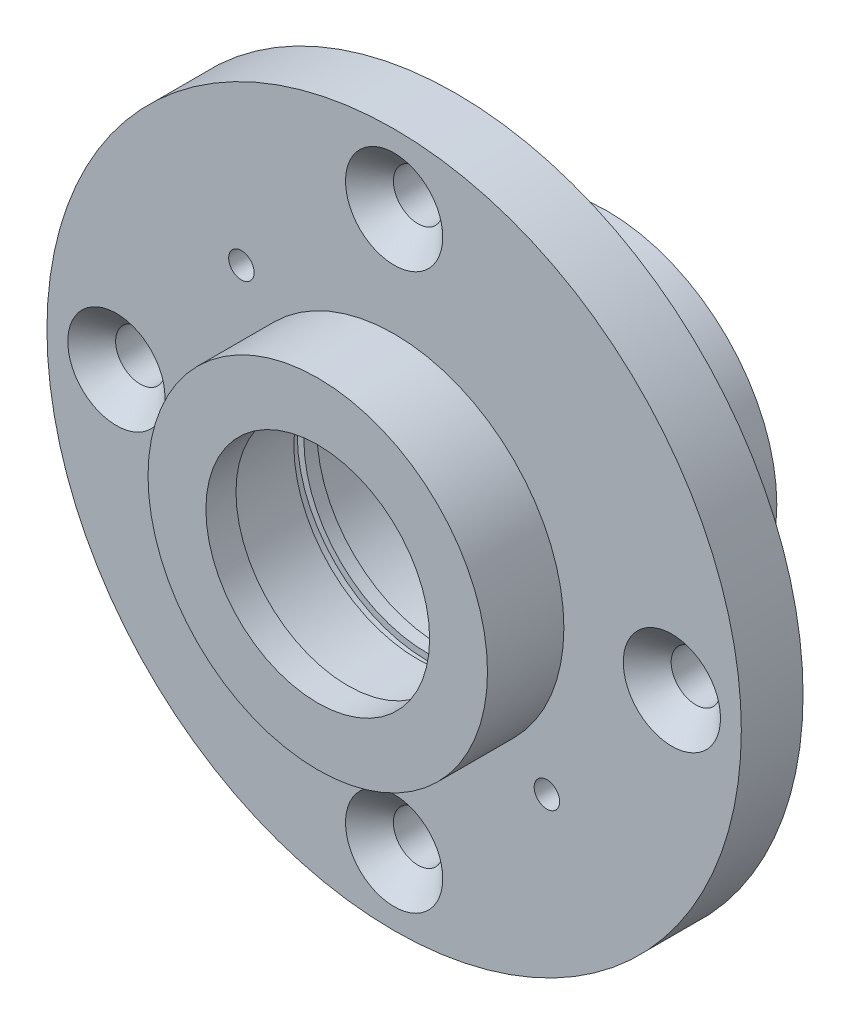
ISO-10303-21;
HEADER;
FILE_DESCRIPTION(('STEP AP214'),'2;1');
FILE_NAME('part.step','',(''),(''),'','','');
FILE_SCHEMA(('AUTOMOTIVE_DESIGN { 1 0 10303 214 1 1 1 1 }'));
ENDSEC;
DATA;
#1=APPLICATION_CONTEXT('core data for automotive mechanical design processes');
#2=APPLICATION_PROTOCOL_DEFINITION('international standard','automotive_design',2000,#1);
#3=PRODUCT_CONTEXT('',#1,'mechanical');
#4=PRODUCT('Part','Part','',(#3));
#5=PRODUCT_RELATED_PRODUCT_CATEGORY('part','',(#4));
#6=PRODUCT_DEFINITION_FORMATION('','',#4);
#7=PRODUCT_DEFINITION_CONTEXT('part definition',#1,'design');
#8=PRODUCT_DEFINITION('design','',#6,#7);
#9=PRODUCT_DEFINITION_SHAPE('','',#8);
#10=(LENGTH_UNIT() NAMED_UNIT(*) SI_UNIT(.MILLI.,.METRE.));
#11=(NAMED_UNIT(*) PLANE_ANGLE_UNIT() SI_UNIT($,.RADIAN.));
#12=(NAMED_UNIT(*) SI_UNIT($,.STERADIAN.) SOLID_ANGLE_UNIT());
#13=UNCERTAINTY_MEASURE_WITH_UNIT(LENGTH_MEASURE(1.E-05),#10,'distance_accuracy_value','');
#14=(GEOMETRIC_REPRESENTATION_CONTEXT(3) GLOBAL_UNCERTAINTY_ASSIGNED_CONTEXT((#13)) GLOBAL_UNIT_ASSIGNED_CONTEXT((#10,
#11,#12)) REPRESENTATION_CONTEXT('',''));
#15=CARTESIAN_POINT('',(0.,0.,0.));
#16=DIRECTION('',(0.,0.,1.));
#17=DIRECTION('',(1.,0.,0.));
#18=AXIS2_PLACEMENT_3D('',#15,#16,#17);
#19=CARTESIAN_POINT('',(0.,0.,33.6));
#20=DIRECTION('',(0.,0.,-1.));
#21=DIRECTION('',(-1.,0.,0.));
#22=AXIS2_PLACEMENT_3D('',#19,#20,#21);
#23=CYLINDRICAL_SURFACE('',#22,16.);
#24=CARTESIAN_POINT('',(0.,0.,23.3));
#25=DIRECTION('',(0.,0.,-1.));
#26=DIRECTION('',(-1.,0.,0.));
#27=AXIS2_PLACEMENT_3D('',#24,#25,#26);
#28=CIRCLE('',#27,16.);
#29=CARTESIAN_POINT('',(-16.,0.,23.3));
#30=VERTEX_POINT('',#29);
#31=EDGE_CURVE('E268',#30,#30,#28,.T.);
#32=ORIENTED_EDGE('',*,*,#31,.F.);
#33=EDGE_LOOP('',(#32));
#34=FACE_BOUND('',#33,.T.);
#35=CARTESIAN_POINT('',(0.,0.,21.6));
#36=DIRECTION('',(0.,0.,-1.));
#37=DIRECTION('',(-1.,0.,0.));
#38=AXIS2_PLACEMENT_3D('',#35,#36,#37);
#39=CIRCLE('',#38,16.);
#40=CARTESIAN_POINT('',(-16.,0.,21.6));
#41=VERTEX_POINT('',#40);
#42=EDGE_CURVE('E43',#41,#41,#39,.F.);
#43=ORIENTED_EDGE('',*,*,#42,.F.);
#44=EDGE_LOOP('',(#43));
#45=FACE_BOUND('',#44,.T.);
#46=ADVANCED_FACE('F39',(#34,#45),#23,.F.);
#47=CARTESIAN_POINT('',(0.,0.,24.6));
#48=DIRECTION('',(0.,0.,-1.));
#49=DIRECTION('',(-1.,0.,0.));
#50=AXIS2_PLACEMENT_3D('',#47,#48,#49);
#51=CIRCLE('',#50,16.);
#52=CARTESIAN_POINT('',(-16.,0.,24.6));
#53=VERTEX_POINT('',#52);
#54=EDGE_CURVE('E259',#53,#53,#51,.T.);
#55=ORIENTED_EDGE('',*,*,#54,.T.);
#56=EDGE_LOOP('',(#55));
#57=FACE_BOUND('',#56,.T.);
#58=CARTESIAN_POINT('',(0.,0.,33.6));
#59=DIRECTION('',(0.,0.,-1.));
#60=DIRECTION('',(-1.,0.,0.));
#61=AXIS2_PLACEMENT_3D('',#58,#59,#60);
#62=CIRCLE('',#61,16.);
#63=CARTESIAN_POINT('',(-16.,0.,33.6));
#64=VERTEX_POINT('',#63);
#65=EDGE_CURVE('E58',#64,#64,#62,.T.);
#66=ORIENTED_EDGE('',*,*,#65,.F.);
#67=EDGE_LOOP('',(#66));
#68=FACE_BOUND('',#67,.T.);
#69=ADVANCED_FACE('F158',(#57,#68),#23,.F.);
#70=CARTESIAN_POINT('',(0.,0.,69.0974746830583));
#71=DIRECTION('',(0.,0.,-1.));
#72=DIRECTION('',(-1.,0.,0.));
#73=AXIS2_PLACEMENT_3D('',#70,#71,#72);
#74=CYLINDRICAL_SURFACE('',#73,17.5);
#75=CARTESIAN_POINT('',(0.,0.,4.6));
#76=DIRECTION('',(0.,0.,-1.));
#77=DIRECTION('',(-1.,0.,0.));
#78=AXIS2_PLACEMENT_3D('',#75,#76,#77);
#79=CIRCLE('',#78,17.5);
#80=CARTESIAN_POINT('',(-17.5,0.,4.6));
#81=VERTEX_POINT('',#80);
#82=EDGE_CURVE('E65',#81,#81,#79,.T.);
#83=ORIENTED_EDGE('',*,*,#82,.T.);
#84=EDGE_LOOP('',(#83));
#85=FACE_BOUND('',#84,.T.);
#86=CARTESIAN_POINT('',(0.,0.,14.6));
#87=DIRECTION('',(0.,0.,1.));
#88=DIRECTION('',(1.,0.,0.));
#89=AXIS2_PLACEMENT_3D('',#86,#87,#88);
#90=CIRCLE('',#89,17.5);
#91=CARTESIAN_POINT('',(17.5,0.,14.6));
#92=VERTEX_POINT('',#91);
#93=EDGE_CURVE('E62',#92,#92,#90,.F.);
#94=ORIENTED_EDGE('',*,*,#93,.F.);
#95=EDGE_LOOP('',(#94));
#96=FACE_BOUND('',#95,.T.);
#97=ADVANCED_FACE('F164',(#85,#96),#74,.F.);
#98=CARTESIAN_POINT('',(0.,0.,37.5));
#99=DIRECTION('',(0.,0.,-1.));
#100=DIRECTION('',(-1.,0.,0.));
#101=AXIS2_PLACEMENT_3D('',#98,#99,#100);
#102=CYLINDRICAL_SURFACE('',#101,14.5);
#103=CARTESIAN_POINT('',(0.,0.,37.5));
#104=DIRECTION('',(0.,0.,1.));
#105=DIRECTION('',(1.,0.,0.));
#106=AXIS2_PLACEMENT_3D('',#103,#104,#105);
#107=CIRCLE('',#106,14.5);
#108=CARTESIAN_POINT('',(14.5,0.,37.5));
#109=VERTEX_POINT('',#108);
#110=EDGE_CURVE('E131',#109,#109,#107,.T.);
#111=ORIENTED_EDGE('',*,*,#110,.T.);
#112=EDGE_LOOP('',(#111));
#113=FACE_BOUND('',#112,.T.);
#114=CARTESIAN_POINT('',(0.,0.,33.6));
#115=DIRECTION('',(0.,0.,-1.));
#116=DIRECTION('',(-1.,0.,0.));
#117=AXIS2_PLACEMENT_3D('',#114,#115,#116);
#118=CIRCLE('',#117,14.5);
#119=CARTESIAN_POINT('',(-14.5,0.,33.6));
#120=VERTEX_POINT('',#119);
#121=EDGE_CURVE('E55',#120,#120,#118,.T.);
#122=ORIENTED_EDGE('',*,*,#121,.T.);
#123=EDGE_LOOP('',(#122));
#124=FACE_BOUND('',#123,.T.);
#125=ADVANCED_FACE('F231',(#113,#124),#102,.F.);
#126=CARTESIAN_POINT('',(0.,0.,37.5));
#127=DIRECTION('',(0.,0.,-1.));
#128=DIRECTION('',(-1.,0.,0.));
#129=AXIS2_PLACEMENT_3D('',#126,#127,#128);
#130=CYLINDRICAL_SURFACE('',#129,22.);
#131=CARTESIAN_POINT('',(0.,0.,0.));
#132=DIRECTION('',(0.,0.,1.));
#133=DIRECTION('',(1.,0.,0.));
#134=AXIS2_PLACEMENT_3D('',#131,#132,#133);
#135=CIRCLE('',#134,22.);
#136=CARTESIAN_POINT('',(22.,0.,0.));
#137=VERTEX_POINT('',#136);
#138=EDGE_CURVE('E52',#137,#137,#135,.T.);
#139=ORIENTED_EDGE('',*,*,#138,.T.);
#140=EDGE_LOOP('',(#139));
#141=FACE_BOUND('',#140,.T.);
#142=CARTESIAN_POINT('',(0.,0.,19.6));
#143=DIRECTION('',(0.,0.,1.));
#144=DIRECTION('',(1.,0.,0.));
#145=AXIS2_PLACEMENT_3D('',#142,#143,#144);
#146=CIRCLE('',#145,22.);
#147=CARTESIAN_POINT('',(22.,0.,19.6));
#148=VERTEX_POINT('',#147);
#149=EDGE_CURVE('E12',#148,#148,#146,.T.);
#150=ORIENTED_EDGE('',*,*,#149,.F.);
#151=EDGE_LOOP('',(#150));
#152=FACE_BOUND('',#151,.T.);
#153=ADVANCED_FACE('F141',(#141,#152),#130,.T.);
#154=CARTESIAN_POINT('',(0.,0.,37.5));
#155=DIRECTION('',(0.,0.,1.));
#156=DIRECTION('',(1.,0.,0.));
#157=AXIS2_PLACEMENT_3D('',#154,#155,#156);
#158=PLANE('',#157);
#159=CARTESIAN_POINT('',(0.,0.,37.5));
#160=DIRECTION('',(0.,0.,1.));
#161=DIRECTION('',(1.,0.,0.));
#162=AXIS2_PLACEMENT_3D('',#159,#160,#161);
#163=CIRCLE('',#162,22.);
#164=CARTESIAN_POINT('',(22.,0.,37.5));
#165=VERTEX_POINT('',#164);
#166=EDGE_CURVE('E47',#165,#165,#163,.T.);
#167=ORIENTED_EDGE('',*,*,#166,.T.);
#168=EDGE_LOOP('',(#167));
#169=FACE_BOUND('',#168,.T.);
#170=ORIENTED_EDGE('',*,*,#110,.F.);
#171=EDGE_LOOP('',(#170));
#172=FACE_BOUND('',#171,.T.);
#173=ADVANCED_FACE('F146',(#169,#172),#158,.T.);
#174=CARTESIAN_POINT('',(0.,0.,0.));
#175=DIRECTION('',(0.,0.,1.));
#176=DIRECTION('',(1.,0.,0.));
#177=AXIS2_PLACEMENT_3D('',#174,#175,#176);
#178=PLANE('',#177);
#179=CARTESIAN_POINT('',(0.,0.,0.));
#180=DIRECTION('',(0.,0.,-1.));
#181=DIRECTION('',(-1.,0.,0.));
#182=AXIS2_PLACEMENT_3D('',#179,#180,#181);
#183=CIRCLE('',#182,17.5);
#184=CARTESIAN_POINT('',(-17.5,0.,0.));
#185=VERTEX_POINT('',#184);
#186=EDGE_CURVE('E57',#185,#185,#183,.T.);
#187=ORIENTED_EDGE('',*,*,#186,.F.);
#188=EDGE_LOOP('',(#187));
#189=FACE_BOUND('',#188,.T.);
#190=ORIENTED_EDGE('',*,*,#138,.F.);
#191=EDGE_LOOP('',(#190));
#192=FACE_BOUND('',#191,.T.);
#193=ADVANCED_FACE('F144',(#189,#192),#178,.F.);
#194=CARTESIAN_POINT('',(0.,0.,27.6));
#195=DIRECTION('',(0.,0.,1.));
#196=DIRECTION('',(1.,0.,0.));
#197=AXIS2_PLACEMENT_3D('',#194,#195,#196);
#198=CIRCLE('',#197,22.);
#199=CARTESIAN_POINT('',(22.,0.,27.6));
#200=VERTEX_POINT('',#199);
#201=EDGE_CURVE('E124',#200,#200,#198,.T.);
#202=ORIENTED_EDGE('',*,*,#201,.T.);
#203=EDGE_LOOP('',(#202));
#204=FACE_BOUND('',#203,.T.);
#205=ORIENTED_EDGE('',*,*,#166,.F.);
#206=EDGE_LOOP('',(#205));
#207=FACE_BOUND('',#206,.T.);
#208=ADVANCED_FACE('F41',(#204,#207),#130,.T.);
#209=CARTESIAN_POINT('',(0.,0.,27.6));
#210=DIRECTION('',(0.,0.,1.));
#211=DIRECTION('',(1.,0.,0.));
#212=AXIS2_PLACEMENT_3D('',#209,#210,#211);
#213=PLANE('',#212);
#214=CARTESIAN_POINT('',(-19.7989898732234,19.7989898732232,27.6));
#215=DIRECTION('',(0.,0.,1.));
#216=DIRECTION('',(1.,0.,0.));
#217=AXIS2_PLACEMENT_3D('',#214,#215,#216);
#218=CIRCLE('',#217,1.65);
#219=CARTESIAN_POINT('',(-18.1489898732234,19.7989898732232,27.6));
#220=VERTEX_POINT('',#219);
#221=EDGE_CURVE('E79',#220,#220,#218,.T.);
#222=ORIENTED_EDGE('',*,*,#221,.F.);
#223=EDGE_LOOP('',(#222));
#224=FACE_BOUND('',#223,.T.);
#225=CARTESIAN_POINT('',(19.7989898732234,-19.7989898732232,27.6));
#226=DIRECTION('',(0.,0.,1.));
#227=DIRECTION('',(1.,0.,0.));
#228=AXIS2_PLACEMENT_3D('',#225,#226,#227);
#229=CIRCLE('',#228,1.65);
#230=CARTESIAN_POINT('',(21.4489898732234,-19.7989898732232,27.6));
#231=VERTEX_POINT('',#230);
#232=EDGE_CURVE('E85',#231,#231,#229,.T.);
#233=ORIENTED_EDGE('',*,*,#232,.F.);
#234=EDGE_LOOP('',(#233));
#235=FACE_BOUND('',#234,.T.);
#236=CARTESIAN_POINT('',(-36.,0.,27.6));
#237=DIRECTION('',(0.,0.,1.));
#238=DIRECTION('',(1.,0.,0.));
#239=AXIS2_PLACEMENT_3D('',#236,#237,#238);
#240=CIRCLE('',#239,6.3);
#241=CARTESIAN_POINT('',(-29.7,0.,27.6));
#242=VERTEX_POINT('',#241);
#243=EDGE_CURVE('E88',#242,#242,#240,.T.);
#244=ORIENTED_EDGE('',*,*,#243,.F.);
#245=EDGE_LOOP('',(#244));
#246=FACE_BOUND('',#245,.T.);
#247=CARTESIAN_POINT('',(0.,36.,27.6));
#248=DIRECTION('',(0.,0.,1.));
#249=DIRECTION('',(1.,0.,0.));
#250=AXIS2_PLACEMENT_3D('',#247,#248,#249);
#251=CIRCLE('',#250,6.3);
#252=CARTESIAN_POINT('',(6.3,36.,27.6));
#253=VERTEX_POINT('',#252);
#254=EDGE_CURVE('E97',#253,#253,#251,.T.);
#255=ORIENTED_EDGE('',*,*,#254,.F.);
#256=EDGE_LOOP('',(#255));
#257=FACE_BOUND('',#256,.T.);
#258=CARTESIAN_POINT('',(36.,0.,27.6));
#259=DIRECTION('',(0.,0.,1.));
#260=DIRECTION('',(1.,0.,0.));
#261=AXIS2_PLACEMENT_3D('',#258,#259,#260);
#262=CIRCLE('',#261,6.3);
#263=CARTESIAN_POINT('',(42.3,0.,27.6));
#264=VERTEX_POINT('',#263);
#265=EDGE_CURVE('E106',#264,#264,#262,.T.);
#266=ORIENTED_EDGE('',*,*,#265,.F.);
#267=EDGE_LOOP('',(#266));
#268=FACE_BOUND('',#267,.T.);
#269=CARTESIAN_POINT('',(0.,-36.,27.6));
#270=DIRECTION('',(0.,0.,1.));
#271=DIRECTION('',(1.,0.,0.));
#272=AXIS2_PLACEMENT_3D('',#269,#270,#271);
#273=CIRCLE('',#272,6.3);
#274=CARTESIAN_POINT('',(6.3,-36.,27.6));
#275=VERTEX_POINT('',#274);
#276=EDGE_CURVE('E115',#275,#275,#273,.T.);
#277=ORIENTED_EDGE('',*,*,#276,.F.);
#278=EDGE_LOOP('',(#277));
#279=FACE_BOUND('',#278,.T.);
#280=CARTESIAN_POINT('',(0.,0.,27.6));
#281=DIRECTION('',(0.,0.,1.));
#282=DIRECTION('',(1.,0.,0.));
#283=AXIS2_PLACEMENT_3D('',#280,#281,#282);
#284=CIRCLE('',#283,45.);
#285=CARTESIAN_POINT('',(45.,0.,27.6));
#286=VERTEX_POINT('',#285);
#287=EDGE_CURVE('E128',#286,#286,#284,.T.);
#288=ORIENTED_EDGE('',*,*,#287,.T.);
#289=EDGE_LOOP('',(#288));
#290=FACE_BOUND('',#289,.T.);
#291=ORIENTED_EDGE('',*,*,#201,.F.);
#292=EDGE_LOOP('',(#291));
#293=FACE_BOUND('',#292,.T.);
#294=ADVANCED_FACE('F152',(#224,#235,#246,#257,#268,#279,#290,#293),#213,.T.);
#295=CARTESIAN_POINT('',(0.,0.,19.6));
#296=DIRECTION('',(0.,0.,1.));
#297=DIRECTION('',(1.,0.,0.));
#298=AXIS2_PLACEMENT_3D('',#295,#296,#297);
#299=PLANE('',#298);
#300=CARTESIAN_POINT('',(-19.7989898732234,19.7989898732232,19.6));
#301=DIRECTION('',(0.,0.,1.));
#302=DIRECTION('',(1.,0.,0.));
#303=AXIS2_PLACEMENT_3D('',#300,#301,#302);
#304=CIRCLE('',#303,1.65);
#305=CARTESIAN_POINT('',(-18.1489898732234,19.7989898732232,19.6));
#306=VERTEX_POINT('',#305);
#307=EDGE_CURVE('E76',#306,#306,#304,.T.);
#308=ORIENTED_EDGE('',*,*,#307,.T.);
#309=EDGE_LOOP('',(#308));
#310=FACE_BOUND('',#309,.T.);
#311=CARTESIAN_POINT('',(19.7989898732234,-19.7989898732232,19.6));
#312=DIRECTION('',(0.,0.,1.));
#313=DIRECTION('',(1.,0.,0.));
#314=AXIS2_PLACEMENT_3D('',#311,#312,#313);
#315=CIRCLE('',#314,1.65);
#316=CARTESIAN_POINT('',(21.4489898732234,-19.7989898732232,19.6));
#317=VERTEX_POINT('',#316);
#318=EDGE_CURVE('E82',#317,#317,#315,.T.);
#319=ORIENTED_EDGE('',*,*,#318,.T.);
#320=EDGE_LOOP('',(#319));
#321=FACE_BOUND('',#320,.T.);
#322=CARTESIAN_POINT('',(-36.,0.,19.6));
#323=DIRECTION('',(0.,0.,1.));
#324=DIRECTION('',(1.,0.,0.));
#325=AXIS2_PLACEMENT_3D('',#322,#323,#324);
#326=CIRCLE('',#325,3.2);
#327=CARTESIAN_POINT('',(-32.8,0.,19.6));
#328=VERTEX_POINT('',#327);
#329=EDGE_CURVE('E94',#328,#328,#326,.T.);
#330=ORIENTED_EDGE('',*,*,#329,.T.);
#331=EDGE_LOOP('',(#330));
#332=FACE_BOUND('',#331,.T.);
#333=CARTESIAN_POINT('',(0.,36.,19.6));
#334=DIRECTION('',(0.,0.,1.));
#335=DIRECTION('',(1.,0.,0.));
#336=AXIS2_PLACEMENT_3D('',#333,#334,#335);
#337=CIRCLE('',#336,3.2);
#338=CARTESIAN_POINT('',(3.2,36.,19.6));
#339=VERTEX_POINT('',#338);
#340=EDGE_CURVE('E103',#339,#339,#337,.T.);
#341=ORIENTED_EDGE('',*,*,#340,.T.);
#342=EDGE_LOOP('',(#341));
#343=FACE_BOUND('',#342,.T.);
#344=CARTESIAN_POINT('',(36.,0.,19.6));
#345=DIRECTION('',(0.,0.,1.));
#346=DIRECTION('',(1.,0.,0.));
#347=AXIS2_PLACEMENT_3D('',#344,#345,#346);
#348=CIRCLE('',#347,3.2);
#349=CARTESIAN_POINT('',(39.2,0.,19.6));
#350=VERTEX_POINT('',#349);
#351=EDGE_CURVE('E112',#350,#350,#348,.T.);
#352=ORIENTED_EDGE('',*,*,#351,.T.);
#353=EDGE_LOOP('',(#352));
#354=FACE_BOUND('',#353,.T.);
#355=CARTESIAN_POINT('',(0.,-36.,19.6));
#356=DIRECTION('',(0.,0.,1.));
#357=DIRECTION('',(1.,0.,0.));
#358=AXIS2_PLACEMENT_3D('',#355,#356,#357);
#359=CIRCLE('',#358,3.2);
#360=CARTESIAN_POINT('',(3.2,-36.,19.6));
#361=VERTEX_POINT('',#360);
#362=EDGE_CURVE('E121',#361,#361,#359,.T.);
#363=ORIENTED_EDGE('',*,*,#362,.T.);
#364=EDGE_LOOP('',(#363));
#365=FACE_BOUND('',#364,.T.);
#366=CARTESIAN_POINT('',(0.,0.,19.6));
#367=DIRECTION('',(0.,0.,1.));
#368=DIRECTION('',(1.,0.,0.));
#369=AXIS2_PLACEMENT_3D('',#366,#367,#368);
#370=CIRCLE('',#369,45.);
#371=CARTESIAN_POINT('',(45.,0.,19.6));
#372=VERTEX_POINT('',#371);
#373=EDGE_CURVE('E127',#372,#372,#370,.T.);
#374=ORIENTED_EDGE('',*,*,#373,.F.);
#375=EDGE_LOOP('',(#374));
#376=FACE_BOUND('',#375,.T.);
#377=ORIENTED_EDGE('',*,*,#149,.T.);
#378=EDGE_LOOP('',(#377));
#379=FACE_BOUND('',#378,.T.);
#380=ADVANCED_FACE('F223',(#310,#321,#332,#343,#354,#365,#376,#379),#299,.F.);
#381=CARTESIAN_POINT('',(0.,0.,27.6));
#382=DIRECTION('',(0.,0.,-1.));
#383=DIRECTION('',(-1.,0.,0.));
#384=AXIS2_PLACEMENT_3D('',#381,#382,#383);
#385=CYLINDRICAL_SURFACE('',#384,45.);
#386=ORIENTED_EDGE('',*,*,#287,.F.);
#387=EDGE_LOOP('',(#386));
#388=FACE_BOUND('',#387,.T.);
#389=ORIENTED_EDGE('',*,*,#373,.T.);
#390=EDGE_LOOP('',(#389));
#391=FACE_BOUND('',#390,.T.);
#392=ADVANCED_FACE('F219',(#388,#391),#385,.T.);
#393=CARTESIAN_POINT('',(0.,-36.,27.6));
#394=DIRECTION('',(0.,0.,1.));
#395=DIRECTION('',(1.,0.,0.));
#396=AXIS2_PLACEMENT_3D('',#393,#394,#395);
#397=CYLINDRICAL_SURFACE('',#396,3.2);
#398=ORIENTED_EDGE('',*,*,#362,.F.);
#399=EDGE_LOOP('',(#398));
#400=FACE_BOUND('',#399,.T.);
#401=CARTESIAN_POINT('',(0.,-36.,24.5));
#402=DIRECTION('',(0.,0.,1.));
#403=DIRECTION('',(1.,0.,0.));
#404=AXIS2_PLACEMENT_3D('',#401,#402,#403);
#405=CIRCLE('',#404,3.2);
#406=CARTESIAN_POINT('',(3.2,-36.,24.5));
#407=VERTEX_POINT('',#406);
#408=EDGE_CURVE('E118',#407,#407,#405,.T.);
#409=ORIENTED_EDGE('',*,*,#408,.T.);
#410=EDGE_LOOP('',(#409));
#411=FACE_BOUND('',#410,.T.);
#412=ADVANCED_FACE('F215',(#400,#411),#397,.F.);
#413=CARTESIAN_POINT('',(0.,-36.,27.6));
#414=DIRECTION('',(0.,0.,1.));
#415=DIRECTION('',(1.,0.,0.));
#416=AXIS2_PLACEMENT_3D('',#413,#414,#415);
#417=CONICAL_SURFACE('',#416,6.3,0.785398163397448);
#418=ORIENTED_EDGE('',*,*,#408,.F.);
#419=EDGE_LOOP('',(#418));
#420=FACE_BOUND('',#419,.T.);
#421=ORIENTED_EDGE('',*,*,#276,.T.);
#422=EDGE_LOOP('',(#421));
#423=FACE_BOUND('',#422,.T.);
#424=ADVANCED_FACE('F211',(#420,#423),#417,.F.);
#425=CARTESIAN_POINT('',(36.,0.,27.6));
#426=DIRECTION('',(0.,0.,1.));
#427=DIRECTION('',(1.,0.,0.));
#428=AXIS2_PLACEMENT_3D('',#425,#426,#427);
#429=CYLINDRICAL_SURFACE('',#428,3.2);
#430=ORIENTED_EDGE('',*,*,#351,.F.);
#431=EDGE_LOOP('',(#430));
#432=FACE_BOUND('',#431,.T.);
#433=CARTESIAN_POINT('',(36.,0.,24.5));
#434=DIRECTION('',(0.,0.,1.));
#435=DIRECTION('',(1.,0.,0.));
#436=AXIS2_PLACEMENT_3D('',#433,#434,#435);
#437=CIRCLE('',#436,3.2);
#438=CARTESIAN_POINT('',(39.2,0.,24.5));
#439=VERTEX_POINT('',#438);
#440=EDGE_CURVE('E109',#439,#439,#437,.T.);
#441=ORIENTED_EDGE('',*,*,#440,.T.);
#442=EDGE_LOOP('',(#441));
#443=FACE_BOUND('',#442,.T.);
#444=ADVANCED_FACE('F207',(#432,#443),#429,.F.);
#445=CARTESIAN_POINT('',(36.,0.,27.6));
#446=DIRECTION('',(0.,0.,1.));
#447=DIRECTION('',(1.,0.,0.));
#448=AXIS2_PLACEMENT_3D('',#445,#446,#447);
#449=CONICAL_SURFACE('',#448,6.3,0.785398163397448);
#450=ORIENTED_EDGE('',*,*,#440,.F.);
#451=EDGE_LOOP('',(#450));
#452=FACE_BOUND('',#451,.T.);
#453=ORIENTED_EDGE('',*,*,#265,.T.);
#454=EDGE_LOOP('',(#453));
#455=FACE_BOUND('',#454,.T.);
#456=ADVANCED_FACE('F203',(#452,#455),#449,.F.);
#457=CARTESIAN_POINT('',(0.,36.,27.6));
#458=DIRECTION('',(0.,0.,1.));
#459=DIRECTION('',(1.,0.,0.));
#460=AXIS2_PLACEMENT_3D('',#457,#458,#459);
#461=CYLINDRICAL_SURFACE('',#460,3.2);
#462=ORIENTED_EDGE('',*,*,#340,.F.);
#463=EDGE_LOOP('',(#462));
#464=FACE_BOUND('',#463,.T.);
#465=CARTESIAN_POINT('',(0.,36.,24.5));
#466=DIRECTION('',(0.,0.,1.));
#467=DIRECTION('',(1.,0.,0.));
#468=AXIS2_PLACEMENT_3D('',#465,#466,#467);
#469=CIRCLE('',#468,3.2);
#470=CARTESIAN_POINT('',(3.2,36.,24.5));
#471=VERTEX_POINT('',#470);
#472=EDGE_CURVE('E100',#471,#471,#469,.T.);
#473=ORIENTED_EDGE('',*,*,#472,.T.);
#474=EDGE_LOOP('',(#473));
#475=FACE_BOUND('',#474,.T.);
#476=ADVANCED_FACE('F199',(#464,#475),#461,.F.);
#477=CARTESIAN_POINT('',(0.,36.,27.6));
#478=DIRECTION('',(0.,0.,1.));
#479=DIRECTION('',(1.,0.,0.));
#480=AXIS2_PLACEMENT_3D('',#477,#478,#479);
#481=CONICAL_SURFACE('',#480,6.3,0.785398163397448);
#482=ORIENTED_EDGE('',*,*,#472,.F.);
#483=EDGE_LOOP('',(#482));
#484=FACE_BOUND('',#483,.T.);
#485=ORIENTED_EDGE('',*,*,#254,.T.);
#486=EDGE_LOOP('',(#485));
#487=FACE_BOUND('',#486,.T.);
#488=ADVANCED_FACE('F195',(#484,#487),#481,.F.);
#489=CARTESIAN_POINT('',(-36.,0.,27.6));
#490=DIRECTION('',(0.,0.,1.));
#491=DIRECTION('',(1.,0.,0.));
#492=AXIS2_PLACEMENT_3D('',#489,#490,#491);
#493=CYLINDRICAL_SURFACE('',#492,3.2);
#494=ORIENTED_EDGE('',*,*,#329,.F.);
#495=EDGE_LOOP('',(#494));
#496=FACE_BOUND('',#495,.T.);
#497=CARTESIAN_POINT('',(-36.,0.,24.5));
#498=DIRECTION('',(0.,0.,1.));
#499=DIRECTION('',(1.,0.,0.));
#500=AXIS2_PLACEMENT_3D('',#497,#498,#499);
#501=CIRCLE('',#500,3.2);
#502=CARTESIAN_POINT('',(-32.8,0.,24.5));
#503=VERTEX_POINT('',#502);
#504=EDGE_CURVE('E91',#503,#503,#501,.T.);
#505=ORIENTED_EDGE('',*,*,#504,.T.);
#506=EDGE_LOOP('',(#505));
#507=FACE_BOUND('',#506,.T.);
#508=ADVANCED_FACE('F191',(#496,#507),#493,.F.);
#509=CARTESIAN_POINT('',(-36.,0.,27.6));
#510=DIRECTION('',(0.,0.,1.));
#511=DIRECTION('',(1.,0.,0.));
#512=AXIS2_PLACEMENT_3D('',#509,#510,#511);
#513=CONICAL_SURFACE('',#512,6.3,0.785398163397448);
#514=ORIENTED_EDGE('',*,*,#504,.F.);
#515=EDGE_LOOP('',(#514));
#516=FACE_BOUND('',#515,.T.);
#517=ORIENTED_EDGE('',*,*,#243,.T.);
#518=EDGE_LOOP('',(#517));
#519=FACE_BOUND('',#518,.T.);
#520=ADVANCED_FACE('F187',(#516,#519),#513,.F.);
#521=CARTESIAN_POINT('',(19.7989898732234,-19.7989898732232,37.5));
#522=DIRECTION('',(0.,0.,1.));
#523=DIRECTION('',(1.,0.,0.));
#524=AXIS2_PLACEMENT_3D('',#521,#522,#523);
#525=CYLINDRICAL_SURFACE('',#524,1.65);
#526=ORIENTED_EDGE('',*,*,#232,.T.);
#527=EDGE_LOOP('',(#526));
#528=FACE_BOUND('',#527,.T.);
#529=ORIENTED_EDGE('',*,*,#318,.F.);
#530=EDGE_LOOP('',(#529));
#531=FACE_BOUND('',#530,.T.);
#532=ADVANCED_FACE('F183',(#528,#531),#525,.F.);
#533=CARTESIAN_POINT('',(-19.7989898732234,19.7989898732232,37.5));
#534=DIRECTION('',(0.,0.,1.));
#535=DIRECTION('',(1.,0.,0.));
#536=AXIS2_PLACEMENT_3D('',#533,#534,#535);
#537=CYLINDRICAL_SURFACE('',#536,1.65);
#538=ORIENTED_EDGE('',*,*,#221,.T.);
#539=EDGE_LOOP('',(#538));
#540=FACE_BOUND('',#539,.T.);
#541=ORIENTED_EDGE('',*,*,#307,.F.);
#542=EDGE_LOOP('',(#541));
#543=FACE_BOUND('',#542,.T.);
#544=ADVANCED_FACE('F179',(#540,#543),#537,.F.);
#545=CARTESIAN_POINT('',(0.,0.,14.6));
#546=DIRECTION('',(0.,0.,1.));
#547=DIRECTION('',(1.,0.,0.));
#548=AXIS2_PLACEMENT_3D('',#545,#546,#547);
#549=PLANE('',#548);
#550=CARTESIAN_POINT('',(0.,0.,14.6));
#551=DIRECTION('',(0.,0.,-1.));
#552=DIRECTION('',(-1.,0.,0.));
#553=AXIS2_PLACEMENT_3D('',#550,#551,#552);
#554=CIRCLE('',#553,16.25);
#555=CARTESIAN_POINT('',(-16.25,0.,14.6));
#556=VERTEX_POINT('',#555);
#557=EDGE_CURVE('E271',#556,#556,#554,.T.);
#558=ORIENTED_EDGE('',*,*,#557,.F.);
#559=EDGE_LOOP('',(#558));
#560=FACE_BOUND('',#559,.T.);
#561=ORIENTED_EDGE('',*,*,#93,.T.);
#562=EDGE_LOOP('',(#561));
#563=FACE_BOUND('',#562,.T.);
#564=ADVANCED_FACE('F175',(#560,#563),#549,.F.);
#565=CARTESIAN_POINT('',(0.,0.,3.));
#566=DIRECTION('',(0.,0.,-1.));
#567=DIRECTION('',(-1.,0.,0.));
#568=AXIS2_PLACEMENT_3D('',#565,#566,#567);
#569=CIRCLE('',#568,17.5);
#570=CARTESIAN_POINT('',(-17.5,0.,3.));
#571=VERTEX_POINT('',#570);
#572=EDGE_CURVE('E254',#571,#571,#569,.T.);
#573=ORIENTED_EDGE('',*,*,#572,.F.);
#574=EDGE_LOOP('',(#573));
#575=FACE_BOUND('',#574,.T.);
#576=ORIENTED_EDGE('',*,*,#186,.T.);
#577=EDGE_LOOP('',(#576));
#578=FACE_BOUND('',#577,.T.);
#579=ADVANCED_FACE('F172',(#575,#578),#74,.F.);
#580=CARTESIAN_POINT('',(0.,0.,33.6));
#581=DIRECTION('',(0.,0.,-1.));
#582=DIRECTION('',(-1.,0.,0.));
#583=AXIS2_PLACEMENT_3D('',#580,#581,#582);
#584=PLANE('',#583);
#585=ORIENTED_EDGE('',*,*,#121,.F.);
#586=EDGE_LOOP('',(#585));
#587=FACE_BOUND('',#586,.T.);
#588=ORIENTED_EDGE('',*,*,#65,.T.);
#589=EDGE_LOOP('',(#588));
#590=FACE_BOUND('',#589,.T.);
#591=ADVANCED_FACE('F170',(#587,#590),#584,.T.);
#592=CARTESIAN_POINT('',(-17.5,0.,4.6));
#593=DIRECTION('',(0.,0.,1.));
#594=DIRECTION('',(1.,0.,0.));
#595=AXIS2_PLACEMENT_3D('',#592,#593,#594);
#596=PLANE('',#595);
#597=ORIENTED_EDGE('',*,*,#82,.F.);
#598=EDGE_LOOP('',(#597));
#599=FACE_BOUND('',#598,.T.);
#600=CARTESIAN_POINT('',(0.,0.,4.6));
#601=DIRECTION('',(0.,0.,-1.));
#602=DIRECTION('',(-1.,0.,0.));
#603=AXIS2_PLACEMENT_3D('',#600,#601,#602);
#604=CIRCLE('',#603,18.5);
#605=CARTESIAN_POINT('',(-18.5,0.,4.6));
#606=VERTEX_POINT('',#605);
#607=EDGE_CURVE('E70',#606,#606,#604,.T.);
#608=ORIENTED_EDGE('',*,*,#607,.T.);
#609=EDGE_LOOP('',(#608));
#610=FACE_BOUND('',#609,.T.);
#611=ADVANCED_FACE('F245',(#599,#610),#596,.F.);
#612=CARTESIAN_POINT('',(0.,0.,0.));
#613=DIRECTION('',(0.,0.,-1.));
#614=DIRECTION('',(-1.,0.,0.));
#615=AXIS2_PLACEMENT_3D('',#612,#613,#614);
#616=CYLINDRICAL_SURFACE('',#615,18.5);
#617=ORIENTED_EDGE('',*,*,#607,.F.);
#618=EDGE_LOOP('',(#617));
#619=FACE_BOUND('',#618,.T.);
#620=CARTESIAN_POINT('',(0.,0.,3.));
#621=DIRECTION('',(0.,0.,-1.));
#622=DIRECTION('',(-1.,0.,0.));
#623=AXIS2_PLACEMENT_3D('',#620,#621,#622);
#624=CIRCLE('',#623,18.5);
#625=CARTESIAN_POINT('',(-18.5,0.,3.));
#626=VERTEX_POINT('',#625);
#627=EDGE_CURVE('E252',#626,#626,#624,.T.);
#628=ORIENTED_EDGE('',*,*,#627,.T.);
#629=EDGE_LOOP('',(#628));
#630=FACE_BOUND('',#629,.T.);
#631=ADVANCED_FACE('F248',(#619,#630),#616,.F.);
#632=CARTESIAN_POINT('',(-17.5,0.,3.));
#633=DIRECTION('',(0.,0.,-1.));
#634=DIRECTION('',(-1.,0.,0.));
#635=AXIS2_PLACEMENT_3D('',#632,#633,#634);
#636=PLANE('',#635);
#637=ORIENTED_EDGE('',*,*,#627,.F.);
#638=EDGE_LOOP('',(#637));
#639=FACE_BOUND('',#638,.T.);
#640=ORIENTED_EDGE('',*,*,#572,.T.);
#641=EDGE_LOOP('',(#640));
#642=FACE_BOUND('',#641,.T.);
#643=ADVANCED_FACE('F302',(#639,#642),#636,.F.);
#644=CARTESIAN_POINT('',(-16.,0.,24.6));
#645=DIRECTION('',(0.,0.,1.));
#646=DIRECTION('',(1.,0.,0.));
#647=AXIS2_PLACEMENT_3D('',#644,#645,#646);
#648=PLANE('',#647);
#649=ORIENTED_EDGE('',*,*,#54,.F.);
#650=EDGE_LOOP('',(#649));
#651=FACE_BOUND('',#650,.T.);
#652=CARTESIAN_POINT('',(0.,0.,24.6));
#653=DIRECTION('',(0.,0.,-1.));
#654=DIRECTION('',(-1.,0.,0.));
#655=AXIS2_PLACEMENT_3D('',#652,#653,#654);
#656=CIRCLE('',#655,16.85);
#657=CARTESIAN_POINT('',(-16.85,0.,24.6));
#658=VERTEX_POINT('',#657);
#659=EDGE_CURVE('E262',#658,#658,#656,.T.);
#660=ORIENTED_EDGE('',*,*,#659,.T.);
#661=EDGE_LOOP('',(#660));
#662=FACE_BOUND('',#661,.T.);
#663=ADVANCED_FACE('F298',(#651,#662),#648,.F.);
#664=CARTESIAN_POINT('',(0.,0.,0.));
#665=DIRECTION('',(0.,0.,-1.));
#666=DIRECTION('',(-1.,0.,0.));
#667=AXIS2_PLACEMENT_3D('',#664,#665,#666);
#668=CYLINDRICAL_SURFACE('',#667,16.85);
#669=ORIENTED_EDGE('',*,*,#659,.F.);
#670=EDGE_LOOP('',(#669));
#671=FACE_BOUND('',#670,.T.);
#672=CARTESIAN_POINT('',(0.,0.,23.3));
#673=DIRECTION('',(0.,0.,-1.));
#674=DIRECTION('',(-1.,0.,0.));
#675=AXIS2_PLACEMENT_3D('',#672,#673,#674);
#676=CIRCLE('',#675,16.85);
#677=CARTESIAN_POINT('',(-16.85,0.,23.3));
#678=VERTEX_POINT('',#677);
#679=EDGE_CURVE('E265',#678,#678,#676,.T.);
#680=ORIENTED_EDGE('',*,*,#679,.T.);
#681=EDGE_LOOP('',(#680));
#682=FACE_BOUND('',#681,.T.);
#683=ADVANCED_FACE('F292',(#671,#682),#668,.F.);
#684=CARTESIAN_POINT('',(-16.,0.,23.3));
#685=DIRECTION('',(0.,0.,-1.));
#686=DIRECTION('',(-1.,0.,0.));
#687=AXIS2_PLACEMENT_3D('',#684,#685,#686);
#688=PLANE('',#687);
#689=ORIENTED_EDGE('',*,*,#679,.F.);
#690=EDGE_LOOP('',(#689));
#691=FACE_BOUND('',#690,.T.);
#692=ORIENTED_EDGE('',*,*,#31,.T.);
#693=EDGE_LOOP('',(#692));
#694=FACE_BOUND('',#693,.T.);
#695=ADVANCED_FACE('F284',(#691,#694),#688,.F.);
#696=CARTESIAN_POINT('',(0.,0.,21.6));
#697=DIRECTION('',(0.,0.,-1.));
#698=DIRECTION('',(-1.,0.,0.));
#699=AXIS2_PLACEMENT_3D('',#696,#697,#698);
#700=PLANE('',#699);
#701=CARTESIAN_POINT('',(0.,0.,21.6));
#702=DIRECTION('',(0.,0.,-1.));
#703=DIRECTION('',(-1.,0.,0.));
#704=AXIS2_PLACEMENT_3D('',#701,#702,#703);
#705=CIRCLE('',#704,16.25);
#706=CARTESIAN_POINT('',(-16.25,0.,21.6));
#707=VERTEX_POINT('',#706);
#708=EDGE_CURVE('E274',#707,#707,#705,.T.);
#709=ORIENTED_EDGE('',*,*,#708,.T.);
#710=EDGE_LOOP('',(#709));
#711=FACE_BOUND('',#710,.T.);
#712=ORIENTED_EDGE('',*,*,#42,.T.);
#713=EDGE_LOOP('',(#712));
#714=FACE_BOUND('',#713,.T.);
#715=ADVANCED_FACE('F281',(#711,#714),#700,.T.);
#716=CARTESIAN_POINT('',(0.,0.,21.6));
#717=DIRECTION('',(0.,0.,-1.));
#718=DIRECTION('',(-1.,0.,0.));
#719=AXIS2_PLACEMENT_3D('',#716,#717,#718);
#720=CYLINDRICAL_SURFACE('',#719,16.25);
#721=ORIENTED_EDGE('',*,*,#708,.F.);
#722=EDGE_LOOP('',(#721));
#723=FACE_BOUND('',#722,.T.);
#724=ORIENTED_EDGE('',*,*,#557,.T.);
#725=EDGE_LOOP('',(#724));
#726=FACE_BOUND('',#725,.T.);
#727=ADVANCED_FACE('F283',(#723,#726),#720,.F.);
#728=CLOSED_SHELL('',(#46,#69,#97,#125,#153,#173,#193,#208,#294,#380,#392,#412,#424,#444,#456,
#476,#488,#508,#520,#532,#544,#564,#579,#591,#611,#631,#643,#663,#683,#695,#715,#727));
#729=MANIFOLD_SOLID_BREP('B2',#728);
#730=ADVANCED_BREP_SHAPE_REPRESENTATION('',(#18,#729),#14);
#731=SHAPE_DEFINITION_REPRESENTATION(#9,#730);
ENDSEC;
END-ISO-10303-21;
